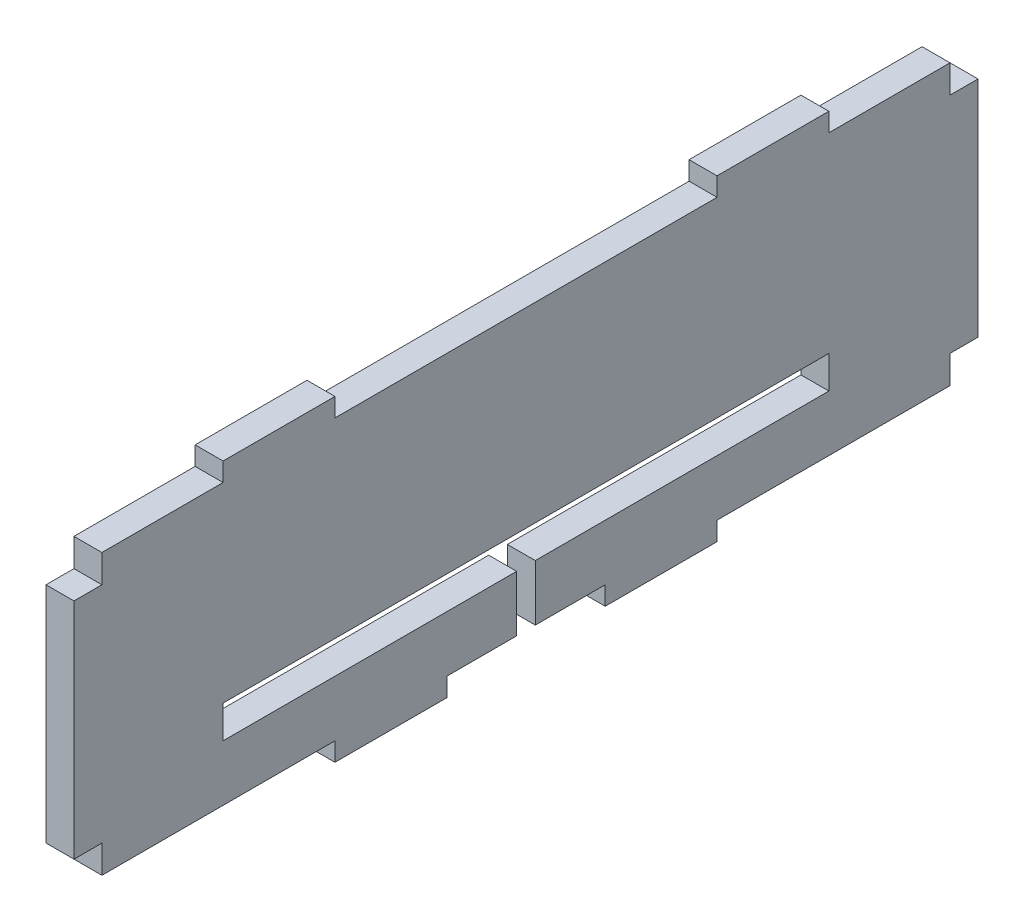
ISO-10303-21;
HEADER;
FILE_DESCRIPTION(('STEP AP214'),'2;1');
FILE_NAME('part.step','',(''),(''),'','','');
FILE_SCHEMA(('AUTOMOTIVE_DESIGN { 1 0 10303 214 1 1 1 1 }'));
ENDSEC;
DATA;
#1=APPLICATION_CONTEXT('core data for automotive mechanical design processes');
#2=APPLICATION_PROTOCOL_DEFINITION('international standard','automotive_design',2000,#1);
#3=PRODUCT_CONTEXT('',#1,'mechanical');
#4=PRODUCT('Part','Part','',(#3));
#5=PRODUCT_RELATED_PRODUCT_CATEGORY('part','',(#4));
#6=PRODUCT_DEFINITION_FORMATION('','',#4);
#7=PRODUCT_DEFINITION_CONTEXT('part definition',#1,'design');
#8=PRODUCT_DEFINITION('design','',#6,#7);
#9=PRODUCT_DEFINITION_SHAPE('','',#8);
#10=(LENGTH_UNIT() NAMED_UNIT(*) SI_UNIT(.MILLI.,.METRE.));
#11=(NAMED_UNIT(*) PLANE_ANGLE_UNIT() SI_UNIT($,.RADIAN.));
#12=(NAMED_UNIT(*) SI_UNIT($,.STERADIAN.) SOLID_ANGLE_UNIT());
#13=UNCERTAINTY_MEASURE_WITH_UNIT(LENGTH_MEASURE(1.E-05),#10,'distance_accuracy_value','');
#14=(GEOMETRIC_REPRESENTATION_CONTEXT(3) GLOBAL_UNCERTAINTY_ASSIGNED_CONTEXT((#13)) GLOBAL_UNIT_ASSIGNED_CONTEXT((#10,
#11,#12)) REPRESENTATION_CONTEXT('',''));
#15=CARTESIAN_POINT('',(0.,0.,0.));
#16=DIRECTION('',(0.,0.,1.));
#17=DIRECTION('',(1.,0.,0.));
#18=AXIS2_PLACEMENT_3D('',#15,#16,#17);
#19=CARTESIAN_POINT('',(3.,29.,0.));
#20=DIRECTION('',(0.,1.,0.));
#21=DIRECTION('',(0.,0.,1.));
#22=AXIS2_PLACEMENT_3D('',#19,#20,#21);
#23=PLANE('',#22);
#24=DIRECTION('',(0.,0.,-1.));
#25=VECTOR('',#24,1.);
#26=CARTESIAN_POINT('',(0.,29.,0.));
#27=LINE('',#26,#25);
#28=CARTESIAN_POINT('',(0.,29.,-94.));
#29=VERTEX_POINT('',#28);
#30=CARTESIAN_POINT('',(0.,29.,-97.));
#31=VERTEX_POINT('',#30);
#32=EDGE_CURVE('E295',#29,#31,#27,.T.);
#33=ORIENTED_EDGE('',*,*,#32,.F.);
#34=DIRECTION('',(-1.,0.,0.));
#35=VECTOR('',#34,1.);
#36=CARTESIAN_POINT('',(3.,29.,-94.));
#37=LINE('',#36,#35);
#38=CARTESIAN_POINT('',(3.,29.,-94.));
#39=VERTEX_POINT('',#38);
#40=EDGE_CURVE('E11',#39,#29,#37,.T.);
#41=ORIENTED_EDGE('',*,*,#40,.F.);
#42=DIRECTION('',(0.,0.,-1.));
#43=VECTOR('',#42,1.);
#44=CARTESIAN_POINT('',(3.,29.,0.));
#45=LINE('',#44,#43);
#46=CARTESIAN_POINT('',(3.,29.,-97.));
#47=VERTEX_POINT('',#46);
#48=EDGE_CURVE('E379',#39,#47,#45,.T.);
#49=ORIENTED_EDGE('',*,*,#48,.T.);
#50=DIRECTION('',(-1.,0.,0.));
#51=VECTOR('',#50,1.);
#52=CARTESIAN_POINT('',(3.,29.,-97.));
#53=LINE('',#52,#51);
#54=EDGE_CURVE('E170',#47,#31,#53,.T.);
#55=ORIENTED_EDGE('',*,*,#54,.T.);
#56=EDGE_LOOP('',(#33,#41,#49,#55));
#57=FACE_BOUND('',#56,.T.);
#58=ADVANCED_FACE('F35',(#57),#23,.T.);
#59=CARTESIAN_POINT('',(3.,0.,-94.));
#60=DIRECTION('',(0.,0.,-1.));
#61=DIRECTION('',(-1.,0.,0.));
#62=AXIS2_PLACEMENT_3D('',#59,#60,#61);
#63=PLANE('',#62);
#64=DIRECTION('',(0.,-1.,0.));
#65=VECTOR('',#64,1.);
#66=CARTESIAN_POINT('',(0.,0.,-94.));
#67=LINE('',#66,#65);
#68=CARTESIAN_POINT('',(0.,32.,-94.));
#69=VERTEX_POINT('',#68);
#70=EDGE_CURVE('E298',#69,#29,#67,.T.);
#71=ORIENTED_EDGE('',*,*,#70,.F.);
#72=DIRECTION('',(-1.,0.,0.));
#73=VECTOR('',#72,1.);
#74=CARTESIAN_POINT('',(3.,32.,-94.));
#75=LINE('',#74,#73);
#76=CARTESIAN_POINT('',(3.,32.,-94.));
#77=VERTEX_POINT('',#76);
#78=EDGE_CURVE('E43',#77,#69,#75,.T.);
#79=ORIENTED_EDGE('',*,*,#78,.F.);
#80=DIRECTION('',(0.,-1.,0.));
#81=VECTOR('',#80,1.);
#82=CARTESIAN_POINT('',(3.,0.,-94.));
#83=LINE('',#82,#81);
#84=EDGE_CURVE('E479',#77,#39,#83,.T.);
#85=ORIENTED_EDGE('',*,*,#84,.T.);
#86=ORIENTED_EDGE('',*,*,#40,.T.);
#87=EDGE_LOOP('',(#71,#79,#85,#86));
#88=FACE_BOUND('',#87,.T.);
#89=ADVANCED_FACE('F467',(#88),#63,.T.);
#90=CARTESIAN_POINT('',(3.,32.,0.));
#91=DIRECTION('',(0.,1.,0.));
#92=DIRECTION('',(0.,0.,1.));
#93=AXIS2_PLACEMENT_3D('',#90,#91,#92);
#94=PLANE('',#93);
#95=DIRECTION('',(0.,0.,-1.));
#96=VECTOR('',#95,1.);
#97=CARTESIAN_POINT('',(0.,32.,0.));
#98=LINE('',#97,#96);
#99=CARTESIAN_POINT('',(0.,32.,-81.));
#100=VERTEX_POINT('',#99);
#101=EDGE_CURVE('E301',#100,#69,#98,.T.);
#102=ORIENTED_EDGE('',*,*,#101,.F.);
#103=DIRECTION('',(-1.,0.,0.));
#104=VECTOR('',#103,1.);
#105=CARTESIAN_POINT('',(3.,32.,-81.));
#106=LINE('',#105,#104);
#107=CARTESIAN_POINT('',(3.,32.,-81.));
#108=VERTEX_POINT('',#107);
#109=EDGE_CURVE('E456',#108,#100,#106,.T.);
#110=ORIENTED_EDGE('',*,*,#109,.F.);
#111=DIRECTION('',(0.,0.,-1.));
#112=VECTOR('',#111,1.);
#113=CARTESIAN_POINT('',(3.,32.,0.));
#114=LINE('',#113,#112);
#115=EDGE_CURVE('E463',#108,#77,#114,.T.);
#116=ORIENTED_EDGE('',*,*,#115,.T.);
#117=ORIENTED_EDGE('',*,*,#78,.T.);
#118=EDGE_LOOP('',(#102,#110,#116,#117));
#119=FACE_BOUND('',#118,.T.);
#120=ADVANCED_FACE('F461',(#119),#94,.T.);
#121=CARTESIAN_POINT('',(3.,0.,-81.));
#122=DIRECTION('',(0.,0.,-1.));
#123=DIRECTION('',(-1.,0.,0.));
#124=AXIS2_PLACEMENT_3D('',#121,#122,#123);
#125=PLANE('',#124);
#126=DIRECTION('',(0.,-1.,0.));
#127=VECTOR('',#126,1.);
#128=CARTESIAN_POINT('',(0.,0.,-81.));
#129=LINE('',#128,#127);
#130=CARTESIAN_POINT('',(0.,34.,-81.));
#131=VERTEX_POINT('',#130);
#132=EDGE_CURVE('E304',#131,#100,#129,.T.);
#133=ORIENTED_EDGE('',*,*,#132,.F.);
#134=DIRECTION('',(-1.,0.,0.));
#135=VECTOR('',#134,1.);
#136=CARTESIAN_POINT('',(3.,34.,-81.));
#137=LINE('',#136,#135);
#138=CARTESIAN_POINT('',(3.,34.,-81.));
#139=VERTEX_POINT('',#138);
#140=EDGE_CURVE('E454',#139,#131,#137,.T.);
#141=ORIENTED_EDGE('',*,*,#140,.F.);
#142=DIRECTION('',(0.,-1.,0.));
#143=VECTOR('',#142,1.);
#144=CARTESIAN_POINT('',(3.,0.,-81.));
#145=LINE('',#144,#143);
#146=EDGE_CURVE('E476',#139,#108,#145,.T.);
#147=ORIENTED_EDGE('',*,*,#146,.T.);
#148=ORIENTED_EDGE('',*,*,#109,.T.);
#149=EDGE_LOOP('',(#133,#141,#147,#148));
#150=FACE_BOUND('',#149,.T.);
#151=ADVANCED_FACE('F473',(#150),#125,.T.);
#152=CARTESIAN_POINT('',(3.,34.,0.));
#153=DIRECTION('',(0.,1.,0.));
#154=DIRECTION('',(0.,0.,1.));
#155=AXIS2_PLACEMENT_3D('',#152,#153,#154);
#156=PLANE('',#155);
#157=DIRECTION('',(0.,0.,-1.));
#158=VECTOR('',#157,1.);
#159=CARTESIAN_POINT('',(0.,34.,0.));
#160=LINE('',#159,#158);
#161=CARTESIAN_POINT('',(0.,34.,-69.));
#162=VERTEX_POINT('',#161);
#163=EDGE_CURVE('E307',#162,#131,#160,.T.);
#164=ORIENTED_EDGE('',*,*,#163,.F.);
#165=DIRECTION('',(-1.,0.,0.));
#166=VECTOR('',#165,1.);
#167=CARTESIAN_POINT('',(3.,34.,-69.));
#168=LINE('',#167,#166);
#169=CARTESIAN_POINT('',(3.,34.,-69.));
#170=VERTEX_POINT('',#169);
#171=EDGE_CURVE('E452',#170,#162,#168,.T.);
#172=ORIENTED_EDGE('',*,*,#171,.F.);
#173=DIRECTION('',(0.,0.,-1.));
#174=VECTOR('',#173,1.);
#175=CARTESIAN_POINT('',(3.,34.,0.));
#176=LINE('',#175,#174);
#177=EDGE_CURVE('E481',#170,#139,#176,.T.);
#178=ORIENTED_EDGE('',*,*,#177,.T.);
#179=ORIENTED_EDGE('',*,*,#140,.T.);
#180=EDGE_LOOP('',(#164,#172,#178,#179));
#181=FACE_BOUND('',#180,.T.);
#182=ADVANCED_FACE('F577',(#181),#156,.T.);
#183=CARTESIAN_POINT('',(3.,0.,-69.));
#184=DIRECTION('',(0.,0.,1.));
#185=DIRECTION('',(1.,0.,0.));
#186=AXIS2_PLACEMENT_3D('',#183,#184,#185);
#187=PLANE('',#186);
#188=DIRECTION('',(0.,1.,0.));
#189=VECTOR('',#188,1.);
#190=CARTESIAN_POINT('',(0.,0.,-69.));
#191=LINE('',#190,#189);
#192=CARTESIAN_POINT('',(0.,32.,-69.));
#193=VERTEX_POINT('',#192);
#194=EDGE_CURVE('E310',#193,#162,#191,.T.);
#195=ORIENTED_EDGE('',*,*,#194,.F.);
#196=DIRECTION('',(-1.,0.,0.));
#197=VECTOR('',#196,1.);
#198=CARTESIAN_POINT('',(3.,32.,-69.));
#199=LINE('',#198,#197);
#200=CARTESIAN_POINT('',(3.,32.,-69.));
#201=VERTEX_POINT('',#200);
#202=EDGE_CURVE('E450',#201,#193,#199,.T.);
#203=ORIENTED_EDGE('',*,*,#202,.F.);
#204=DIRECTION('',(0.,1.,0.));
#205=VECTOR('',#204,1.);
#206=CARTESIAN_POINT('',(3.,0.,-69.));
#207=LINE('',#206,#205);
#208=EDGE_CURVE('E487',#201,#170,#207,.T.);
#209=ORIENTED_EDGE('',*,*,#208,.T.);
#210=ORIENTED_EDGE('',*,*,#171,.T.);
#211=EDGE_LOOP('',(#195,#203,#209,#210));
#212=FACE_BOUND('',#211,.T.);
#213=ADVANCED_FACE('F578',(#212),#187,.T.);
#214=CARTESIAN_POINT('',(3.,32.,0.));
#215=DIRECTION('',(0.,1.,0.));
#216=DIRECTION('',(0.,0.,1.));
#217=AXIS2_PLACEMENT_3D('',#214,#215,#216);
#218=PLANE('',#217);
#219=DIRECTION('',(0.,0.,-1.));
#220=VECTOR('',#219,1.);
#221=CARTESIAN_POINT('',(0.,32.,0.));
#222=LINE('',#221,#220);
#223=CARTESIAN_POINT('',(0.,32.,-28.));
#224=VERTEX_POINT('',#223);
#225=EDGE_CURVE('E314',#224,#193,#222,.T.);
#226=ORIENTED_EDGE('',*,*,#225,.F.);
#227=DIRECTION('',(-1.,0.,0.));
#228=VECTOR('',#227,1.);
#229=CARTESIAN_POINT('',(3.,32.,-28.));
#230=LINE('',#229,#228);
#231=CARTESIAN_POINT('',(3.,32.,-28.));
#232=VERTEX_POINT('',#231);
#233=EDGE_CURVE('E448',#232,#224,#230,.T.);
#234=ORIENTED_EDGE('',*,*,#233,.F.);
#235=DIRECTION('',(0.,0.,-1.));
#236=VECTOR('',#235,1.);
#237=CARTESIAN_POINT('',(3.,32.,0.));
#238=LINE('',#237,#236);
#239=EDGE_CURVE('E491',#232,#201,#238,.T.);
#240=ORIENTED_EDGE('',*,*,#239,.T.);
#241=ORIENTED_EDGE('',*,*,#202,.T.);
#242=EDGE_LOOP('',(#226,#234,#240,#241));
#243=FACE_BOUND('',#242,.T.);
#244=ADVANCED_FACE('F581',(#243),#218,.T.);
#245=CARTESIAN_POINT('',(3.,0.,-28.));
#246=DIRECTION('',(0.,0.,-1.));
#247=DIRECTION('',(-1.,0.,0.));
#248=AXIS2_PLACEMENT_3D('',#245,#246,#247);
#249=PLANE('',#248);
#250=DIRECTION('',(0.,-1.,0.));
#251=VECTOR('',#250,1.);
#252=CARTESIAN_POINT('',(0.,0.,-28.));
#253=LINE('',#252,#251);
#254=CARTESIAN_POINT('',(0.,34.,-28.));
#255=VERTEX_POINT('',#254);
#256=EDGE_CURVE('E317',#255,#224,#253,.T.);
#257=ORIENTED_EDGE('',*,*,#256,.F.);
#258=DIRECTION('',(-1.,0.,0.));
#259=VECTOR('',#258,1.);
#260=CARTESIAN_POINT('',(3.,34.,-28.));
#261=LINE('',#260,#259);
#262=CARTESIAN_POINT('',(3.,34.,-28.));
#263=VERTEX_POINT('',#262);
#264=EDGE_CURVE('E446',#263,#255,#261,.T.);
#265=ORIENTED_EDGE('',*,*,#264,.F.);
#266=DIRECTION('',(0.,-1.,0.));
#267=VECTOR('',#266,1.);
#268=CARTESIAN_POINT('',(3.,0.,-28.));
#269=LINE('',#268,#267);
#270=EDGE_CURVE('E494',#263,#232,#269,.T.);
#271=ORIENTED_EDGE('',*,*,#270,.T.);
#272=ORIENTED_EDGE('',*,*,#233,.T.);
#273=EDGE_LOOP('',(#257,#265,#271,#272));
#274=FACE_BOUND('',#273,.T.);
#275=ADVANCED_FACE('F585',(#274),#249,.T.);
#276=CARTESIAN_POINT('',(0.,34.,-16.));
#277=VERTEX_POINT('',#276);
#278=EDGE_CURVE('E311',#277,#255,#160,.T.);
#279=ORIENTED_EDGE('',*,*,#278,.F.);
#280=DIRECTION('',(-1.,0.,0.));
#281=VECTOR('',#280,1.);
#282=CARTESIAN_POINT('',(3.,34.,-16.));
#283=LINE('',#282,#281);
#284=CARTESIAN_POINT('',(3.,34.,-16.));
#285=VERTEX_POINT('',#284);
#286=EDGE_CURVE('E444',#285,#277,#283,.T.);
#287=ORIENTED_EDGE('',*,*,#286,.F.);
#288=EDGE_CURVE('E488',#285,#263,#176,.T.);
#289=ORIENTED_EDGE('',*,*,#288,.T.);
#290=ORIENTED_EDGE('',*,*,#264,.T.);
#291=EDGE_LOOP('',(#279,#287,#289,#290));
#292=FACE_BOUND('',#291,.T.);
#293=ADVANCED_FACE('F589',(#292),#156,.T.);
#294=CARTESIAN_POINT('',(3.,0.,-16.));
#295=DIRECTION('',(0.,0.,1.));
#296=DIRECTION('',(1.,0.,0.));
#297=AXIS2_PLACEMENT_3D('',#294,#295,#296);
#298=PLANE('',#297);
#299=DIRECTION('',(0.,1.,0.));
#300=VECTOR('',#299,1.);
#301=CARTESIAN_POINT('',(0.,0.,-16.));
#302=LINE('',#301,#300);
#303=CARTESIAN_POINT('',(0.,32.,-16.));
#304=VERTEX_POINT('',#303);
#305=EDGE_CURVE('E320',#304,#277,#302,.T.);
#306=ORIENTED_EDGE('',*,*,#305,.F.);
#307=DIRECTION('',(-1.,0.,0.));
#308=VECTOR('',#307,1.);
#309=CARTESIAN_POINT('',(3.,32.,-16.));
#310=LINE('',#309,#308);
#311=CARTESIAN_POINT('',(3.,32.,-16.));
#312=VERTEX_POINT('',#311);
#313=EDGE_CURVE('E442',#312,#304,#310,.T.);
#314=ORIENTED_EDGE('',*,*,#313,.F.);
#315=DIRECTION('',(0.,1.,0.));
#316=VECTOR('',#315,1.);
#317=CARTESIAN_POINT('',(3.,0.,-16.));
#318=LINE('',#317,#316);
#319=EDGE_CURVE('E497',#312,#285,#318,.T.);
#320=ORIENTED_EDGE('',*,*,#319,.T.);
#321=ORIENTED_EDGE('',*,*,#286,.T.);
#322=EDGE_LOOP('',(#306,#314,#320,#321));
#323=FACE_BOUND('',#322,.T.);
#324=ADVANCED_FACE('F593',(#323),#298,.T.);
#325=CARTESIAN_POINT('',(3.,32.,0.));
#326=DIRECTION('',(0.,1.,0.));
#327=DIRECTION('',(0.,0.,1.));
#328=AXIS2_PLACEMENT_3D('',#325,#326,#327);
#329=PLANE('',#328);
#330=DIRECTION('',(0.,0.,-1.));
#331=VECTOR('',#330,1.);
#332=CARTESIAN_POINT('',(0.,32.,0.));
#333=LINE('',#332,#331);
#334=CARTESIAN_POINT('',(0.,32.,-2.99999999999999));
#335=VERTEX_POINT('',#334);
#336=EDGE_CURVE('E323',#335,#304,#333,.T.);
#337=ORIENTED_EDGE('',*,*,#336,.F.);
#338=DIRECTION('',(-1.,0.,0.));
#339=VECTOR('',#338,1.);
#340=CARTESIAN_POINT('',(3.,32.,-2.99999999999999));
#341=LINE('',#340,#339);
#342=CARTESIAN_POINT('',(3.,32.,-2.99999999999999));
#343=VERTEX_POINT('',#342);
#344=EDGE_CURVE('E440',#343,#335,#341,.T.);
#345=ORIENTED_EDGE('',*,*,#344,.F.);
#346=DIRECTION('',(0.,0.,-1.));
#347=VECTOR('',#346,1.);
#348=CARTESIAN_POINT('',(3.,32.,0.));
#349=LINE('',#348,#347);
#350=EDGE_CURVE('E500',#343,#312,#349,.T.);
#351=ORIENTED_EDGE('',*,*,#350,.T.);
#352=ORIENTED_EDGE('',*,*,#313,.T.);
#353=EDGE_LOOP('',(#337,#345,#351,#352));
#354=FACE_BOUND('',#353,.T.);
#355=ADVANCED_FACE('F597',(#354),#329,.T.);
#356=CARTESIAN_POINT('',(3.,0.,-2.99999999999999));
#357=DIRECTION('',(0.,0.,1.));
#358=DIRECTION('',(1.,0.,0.));
#359=AXIS2_PLACEMENT_3D('',#356,#357,#358);
#360=PLANE('',#359);
#361=DIRECTION('',(0.,1.,0.));
#362=VECTOR('',#361,1.);
#363=CARTESIAN_POINT('',(0.,0.,-2.99999999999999));
#364=LINE('',#363,#362);
#365=CARTESIAN_POINT('',(0.,29.,-2.99999999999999));
#366=VERTEX_POINT('',#365);
#367=EDGE_CURVE('E326',#366,#335,#364,.T.);
#368=ORIENTED_EDGE('',*,*,#367,.F.);
#369=DIRECTION('',(-1.,0.,0.));
#370=VECTOR('',#369,1.);
#371=CARTESIAN_POINT('',(3.,29.,-2.99999999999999));
#372=LINE('',#371,#370);
#373=CARTESIAN_POINT('',(3.,29.,-2.99999999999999));
#374=VERTEX_POINT('',#373);
#375=EDGE_CURVE('E438',#374,#366,#372,.T.);
#376=ORIENTED_EDGE('',*,*,#375,.F.);
#377=DIRECTION('',(0.,1.,0.));
#378=VECTOR('',#377,1.);
#379=CARTESIAN_POINT('',(3.,0.,-2.99999999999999));
#380=LINE('',#379,#378);
#381=EDGE_CURVE('E503',#374,#343,#380,.T.);
#382=ORIENTED_EDGE('',*,*,#381,.T.);
#383=ORIENTED_EDGE('',*,*,#344,.T.);
#384=EDGE_LOOP('',(#368,#376,#382,#383));
#385=FACE_BOUND('',#384,.T.);
#386=ADVANCED_FACE('F601',(#385),#360,.T.);
#387=CARTESIAN_POINT('',(3.,29.,0.));
#388=DIRECTION('',(0.,1.,0.));
#389=DIRECTION('',(0.,0.,1.));
#390=AXIS2_PLACEMENT_3D('',#387,#388,#389);
#391=PLANE('',#390);
#392=DIRECTION('',(0.,0.,-1.));
#393=VECTOR('',#392,1.);
#394=CARTESIAN_POINT('',(0.,29.,0.));
#395=LINE('',#394,#393);
#396=CARTESIAN_POINT('',(0.,29.,0.));
#397=VERTEX_POINT('',#396);
#398=EDGE_CURVE('E329',#397,#366,#395,.T.);
#399=ORIENTED_EDGE('',*,*,#398,.F.);
#400=DIRECTION('',(-1.,0.,0.));
#401=VECTOR('',#400,1.);
#402=CARTESIAN_POINT('',(3.,29.,0.));
#403=LINE('',#402,#401);
#404=CARTESIAN_POINT('',(3.,29.,0.));
#405=VERTEX_POINT('',#404);
#406=EDGE_CURVE('E436',#405,#397,#403,.T.);
#407=ORIENTED_EDGE('',*,*,#406,.F.);
#408=DIRECTION('',(0.,0.,-1.));
#409=VECTOR('',#408,1.);
#410=CARTESIAN_POINT('',(3.,29.,0.));
#411=LINE('',#410,#409);
#412=EDGE_CURVE('E506',#405,#374,#411,.T.);
#413=ORIENTED_EDGE('',*,*,#412,.T.);
#414=ORIENTED_EDGE('',*,*,#375,.T.);
#415=EDGE_LOOP('',(#399,#407,#413,#414));
#416=FACE_BOUND('',#415,.T.);
#417=ADVANCED_FACE('F605',(#416),#391,.T.);
#418=CARTESIAN_POINT('',(3.,0.,0.));
#419=DIRECTION('',(0.,0.,-1.));
#420=DIRECTION('',(-1.,0.,0.));
#421=AXIS2_PLACEMENT_3D('',#418,#419,#420);
#422=PLANE('',#421);
#423=DIRECTION('',(0.,-1.,0.));
#424=VECTOR('',#423,1.);
#425=CARTESIAN_POINT('',(0.,0.,0.));
#426=LINE('',#425,#424);
#427=CARTESIAN_POINT('',(0.,5.,0.));
#428=VERTEX_POINT('',#427);
#429=EDGE_CURVE('E332',#397,#428,#426,.T.);
#430=ORIENTED_EDGE('',*,*,#429,.T.);
#431=DIRECTION('',(-1.,0.,0.));
#432=VECTOR('',#431,1.);
#433=CARTESIAN_POINT('',(3.,5.,0.));
#434=LINE('',#433,#432);
#435=CARTESIAN_POINT('',(3.,5.,0.));
#436=VERTEX_POINT('',#435);
#437=EDGE_CURVE('E433',#436,#428,#434,.T.);
#438=ORIENTED_EDGE('',*,*,#437,.F.);
#439=DIRECTION('',(0.,-1.,0.));
#440=VECTOR('',#439,1.);
#441=CARTESIAN_POINT('',(3.,0.,0.));
#442=LINE('',#441,#440);
#443=EDGE_CURVE('E509',#405,#436,#442,.T.);
#444=ORIENTED_EDGE('',*,*,#443,.F.);
#445=ORIENTED_EDGE('',*,*,#406,.T.);
#446=EDGE_LOOP('',(#430,#438,#444,#445));
#447=FACE_BOUND('',#446,.T.);
#448=ADVANCED_FACE('F609',(#447),#422,.F.);
#449=CARTESIAN_POINT('',(3.,5.,0.));
#450=DIRECTION('',(0.,1.,0.));
#451=DIRECTION('',(0.,0.,1.));
#452=AXIS2_PLACEMENT_3D('',#449,#450,#451);
#453=PLANE('',#452);
#454=DIRECTION('',(0.,0.,-1.));
#455=VECTOR('',#454,1.);
#456=CARTESIAN_POINT('',(0.,5.,0.));
#457=LINE('',#456,#455);
#458=CARTESIAN_POINT('',(0.,5.,-3.));
#459=VERTEX_POINT('',#458);
#460=EDGE_CURVE('E334',#428,#459,#457,.T.);
#461=ORIENTED_EDGE('',*,*,#460,.T.);
#462=DIRECTION('',(-1.,0.,0.));
#463=VECTOR('',#462,1.);
#464=CARTESIAN_POINT('',(3.,5.,-3.));
#465=LINE('',#464,#463);
#466=CARTESIAN_POINT('',(3.,5.,-3.));
#467=VERTEX_POINT('',#466);
#468=EDGE_CURVE('E430',#467,#459,#465,.T.);
#469=ORIENTED_EDGE('',*,*,#468,.F.);
#470=DIRECTION('',(0.,0.,-1.));
#471=VECTOR('',#470,1.);
#472=CARTESIAN_POINT('',(3.,5.,0.));
#473=LINE('',#472,#471);
#474=EDGE_CURVE('E511',#436,#467,#473,.T.);
#475=ORIENTED_EDGE('',*,*,#474,.F.);
#476=ORIENTED_EDGE('',*,*,#437,.T.);
#477=EDGE_LOOP('',(#461,#469,#475,#476));
#478=FACE_BOUND('',#477,.T.);
#479=ADVANCED_FACE('F613',(#478),#453,.F.);
#480=CARTESIAN_POINT('',(3.,0.,-3.));
#481=DIRECTION('',(0.,0.,-1.));
#482=DIRECTION('',(0.,1.,0.));
#483=AXIS2_PLACEMENT_3D('',#480,#481,#482);
#484=PLANE('',#483);
#485=DIRECTION('',(0.,-1.,0.));
#486=VECTOR('',#485,1.);
#487=CARTESIAN_POINT('',(0.,0.,-3.));
#488=LINE('',#487,#486);
#489=CARTESIAN_POINT('',(0.,2.,-3.));
#490=VERTEX_POINT('',#489);
#491=EDGE_CURVE('E336',#459,#490,#488,.T.);
#492=ORIENTED_EDGE('',*,*,#491,.T.);
#493=DIRECTION('',(-1.,0.,0.));
#494=VECTOR('',#493,1.);
#495=CARTESIAN_POINT('',(3.,2.,-3.));
#496=LINE('',#495,#494);
#497=CARTESIAN_POINT('',(3.,2.,-3.));
#498=VERTEX_POINT('',#497);
#499=EDGE_CURVE('E427',#498,#490,#496,.T.);
#500=ORIENTED_EDGE('',*,*,#499,.F.);
#501=DIRECTION('',(0.,-1.,0.));
#502=VECTOR('',#501,1.);
#503=CARTESIAN_POINT('',(3.,0.,-3.));
#504=LINE('',#503,#502);
#505=EDGE_CURVE('E513',#467,#498,#504,.T.);
#506=ORIENTED_EDGE('',*,*,#505,.F.);
#507=ORIENTED_EDGE('',*,*,#468,.T.);
#508=EDGE_LOOP('',(#492,#500,#506,#507));
#509=FACE_BOUND('',#508,.T.);
#510=ADVANCED_FACE('F617',(#509),#484,.F.);
#511=CARTESIAN_POINT('',(3.,2.,0.));
#512=DIRECTION('',(0.,1.,0.));
#513=DIRECTION('',(0.,0.,1.));
#514=AXIS2_PLACEMENT_3D('',#511,#512,#513);
#515=PLANE('',#514);
#516=DIRECTION('',(0.,0.,-1.));
#517=VECTOR('',#516,1.);
#518=CARTESIAN_POINT('',(0.,2.,0.));
#519=LINE('',#518,#517);
#520=CARTESIAN_POINT('',(0.,2.,-28.));
#521=VERTEX_POINT('',#520);
#522=EDGE_CURVE('E338',#490,#521,#519,.T.);
#523=ORIENTED_EDGE('',*,*,#522,.T.);
#524=DIRECTION('',(-1.,0.,0.));
#525=VECTOR('',#524,1.);
#526=CARTESIAN_POINT('',(3.,2.,-28.));
#527=LINE('',#526,#525);
#528=CARTESIAN_POINT('',(3.,2.,-28.));
#529=VERTEX_POINT('',#528);
#530=EDGE_CURVE('E424',#529,#521,#527,.T.);
#531=ORIENTED_EDGE('',*,*,#530,.F.);
#532=DIRECTION('',(0.,0.,-1.));
#533=VECTOR('',#532,1.);
#534=CARTESIAN_POINT('',(3.,2.,0.));
#535=LINE('',#534,#533);
#536=EDGE_CURVE('E515',#498,#529,#535,.T.);
#537=ORIENTED_EDGE('',*,*,#536,.F.);
#538=ORIENTED_EDGE('',*,*,#499,.T.);
#539=EDGE_LOOP('',(#523,#531,#537,#538));
#540=FACE_BOUND('',#539,.T.);
#541=ADVANCED_FACE('F621',(#540),#515,.F.);
#542=CARTESIAN_POINT('',(3.,0.,-28.));
#543=DIRECTION('',(0.,0.,-1.));
#544=DIRECTION('',(-1.,0.,0.));
#545=AXIS2_PLACEMENT_3D('',#542,#543,#544);
#546=PLANE('',#545);
#547=DIRECTION('',(0.,-1.,0.));
#548=VECTOR('',#547,1.);
#549=CARTESIAN_POINT('',(0.,0.,-28.));
#550=LINE('',#549,#548);
#551=CARTESIAN_POINT('',(0.,0.,-28.));
#552=VERTEX_POINT('',#551);
#553=EDGE_CURVE('E340',#521,#552,#550,.T.);
#554=ORIENTED_EDGE('',*,*,#553,.T.);
#555=DIRECTION('',(-1.,0.,0.));
#556=VECTOR('',#555,1.);
#557=CARTESIAN_POINT('',(3.,0.,-28.));
#558=LINE('',#557,#556);
#559=CARTESIAN_POINT('',(3.,0.,-28.));
#560=VERTEX_POINT('',#559);
#561=EDGE_CURVE('E421',#560,#552,#558,.T.);
#562=ORIENTED_EDGE('',*,*,#561,.F.);
#563=DIRECTION('',(0.,-1.,0.));
#564=VECTOR('',#563,1.);
#565=CARTESIAN_POINT('',(3.,0.,-28.));
#566=LINE('',#565,#564);
#567=EDGE_CURVE('E517',#529,#560,#566,.T.);
#568=ORIENTED_EDGE('',*,*,#567,.F.);
#569=ORIENTED_EDGE('',*,*,#530,.T.);
#570=EDGE_LOOP('',(#554,#562,#568,#569));
#571=FACE_BOUND('',#570,.T.);
#572=ADVANCED_FACE('F625',(#571),#546,.F.);
#573=CARTESIAN_POINT('',(3.,0.,0.));
#574=DIRECTION('',(0.,1.,0.));
#575=DIRECTION('',(0.,0.,1.));
#576=AXIS2_PLACEMENT_3D('',#573,#574,#575);
#577=PLANE('',#576);
#578=DIRECTION('',(0.,0.,-1.));
#579=VECTOR('',#578,1.);
#580=CARTESIAN_POINT('',(0.,0.,0.));
#581=LINE('',#580,#579);
#582=CARTESIAN_POINT('',(0.,0.,-40.));
#583=VERTEX_POINT('',#582);
#584=EDGE_CURVE('E342',#552,#583,#581,.T.);
#585=ORIENTED_EDGE('',*,*,#584,.T.);
#586=DIRECTION('',(-1.,0.,0.));
#587=VECTOR('',#586,1.);
#588=CARTESIAN_POINT('',(3.,0.,-40.));
#589=LINE('',#588,#587);
#590=CARTESIAN_POINT('',(3.,0.,-40.));
#591=VERTEX_POINT('',#590);
#592=EDGE_CURVE('E418',#591,#583,#589,.T.);
#593=ORIENTED_EDGE('',*,*,#592,.F.);
#594=DIRECTION('',(0.,0.,-1.));
#595=VECTOR('',#594,1.);
#596=CARTESIAN_POINT('',(3.,0.,0.));
#597=LINE('',#596,#595);
#598=EDGE_CURVE('E519',#560,#591,#597,.T.);
#599=ORIENTED_EDGE('',*,*,#598,.F.);
#600=ORIENTED_EDGE('',*,*,#561,.T.);
#601=EDGE_LOOP('',(#585,#593,#599,#600));
#602=FACE_BOUND('',#601,.T.);
#603=ADVANCED_FACE('F629',(#602),#577,.F.);
#604=CARTESIAN_POINT('',(3.,0.,-40.));
#605=DIRECTION('',(0.,0.,1.));
#606=DIRECTION('',(1.,0.,0.));
#607=AXIS2_PLACEMENT_3D('',#604,#605,#606);
#608=PLANE('',#607);
#609=DIRECTION('',(0.,1.,0.));
#610=VECTOR('',#609,1.);
#611=CARTESIAN_POINT('',(0.,0.,-40.));
#612=LINE('',#611,#610);
#613=CARTESIAN_POINT('',(0.,2.,-40.));
#614=VERTEX_POINT('',#613);
#615=EDGE_CURVE('E344',#583,#614,#612,.T.);
#616=ORIENTED_EDGE('',*,*,#615,.T.);
#617=DIRECTION('',(-1.,0.,0.));
#618=VECTOR('',#617,1.);
#619=CARTESIAN_POINT('',(3.,2.,-40.));
#620=LINE('',#619,#618);
#621=CARTESIAN_POINT('',(3.,2.,-40.));
#622=VERTEX_POINT('',#621);
#623=EDGE_CURVE('E416',#622,#614,#620,.T.);
#624=ORIENTED_EDGE('',*,*,#623,.F.);
#625=DIRECTION('',(0.,1.,0.));
#626=VECTOR('',#625,1.);
#627=CARTESIAN_POINT('',(3.,0.,-40.));
#628=LINE('',#627,#626);
#629=EDGE_CURVE('E521',#591,#622,#628,.T.);
#630=ORIENTED_EDGE('',*,*,#629,.F.);
#631=ORIENTED_EDGE('',*,*,#592,.T.);
#632=EDGE_LOOP('',(#616,#624,#630,#631));
#633=FACE_BOUND('',#632,.T.);
#634=ADVANCED_FACE('F631',(#633),#608,.F.);
#635=CARTESIAN_POINT('',(3.,2.,0.));
#636=DIRECTION('',(0.,-1.,0.));
#637=DIRECTION('',(0.,0.,-1.));
#638=AXIS2_PLACEMENT_3D('',#635,#636,#637);
#639=PLANE('',#638);
#640=DIRECTION('',(0.,0.,1.));
#641=VECTOR('',#640,1.);
#642=CARTESIAN_POINT('',(0.,2.,0.));
#643=LINE('',#642,#641);
#644=CARTESIAN_POINT('',(0.,2.,-47.5));
#645=VERTEX_POINT('',#644);
#646=EDGE_CURVE('E348',#645,#614,#643,.T.);
#647=ORIENTED_EDGE('',*,*,#646,.F.);
#648=DIRECTION('',(-1.,0.,0.));
#649=VECTOR('',#648,1.);
#650=CARTESIAN_POINT('',(3.,2.,-47.5));
#651=LINE('',#650,#649);
#652=CARTESIAN_POINT('',(3.,2.,-47.5));
#653=VERTEX_POINT('',#652);
#654=EDGE_CURVE('E414',#653,#645,#651,.T.);
#655=ORIENTED_EDGE('',*,*,#654,.F.);
#656=DIRECTION('',(0.,0.,1.));
#657=VECTOR('',#656,1.);
#658=CARTESIAN_POINT('',(3.,2.,0.));
#659=LINE('',#658,#657);
#660=EDGE_CURVE('E524',#653,#622,#659,.T.);
#661=ORIENTED_EDGE('',*,*,#660,.T.);
#662=ORIENTED_EDGE('',*,*,#623,.T.);
#663=EDGE_LOOP('',(#647,#655,#661,#662));
#664=FACE_BOUND('',#663,.T.);
#665=ADVANCED_FACE('F634',(#664),#639,.T.);
#666=CARTESIAN_POINT('',(3.,0.,-47.5));
#667=DIRECTION('',(0.,0.,-1.));
#668=DIRECTION('',(-1.,0.,0.));
#669=AXIS2_PLACEMENT_3D('',#666,#667,#668);
#670=PLANE('',#669);
#671=DIRECTION('',(0.,-1.,0.));
#672=VECTOR('',#671,1.);
#673=CARTESIAN_POINT('',(0.,0.,-47.5));
#674=LINE('',#673,#672);
#675=CARTESIAN_POINT('',(0.,8.,-47.5));
#676=VERTEX_POINT('',#675);
#677=EDGE_CURVE('E351',#676,#645,#674,.T.);
#678=ORIENTED_EDGE('',*,*,#677,.F.);
#679=DIRECTION('',(-1.,0.,0.));
#680=VECTOR('',#679,1.);
#681=CARTESIAN_POINT('',(3.,8.,-47.5));
#682=LINE('',#681,#680);
#683=CARTESIAN_POINT('',(3.,8.,-47.5));
#684=VERTEX_POINT('',#683);
#685=EDGE_CURVE('E412',#684,#676,#682,.T.);
#686=ORIENTED_EDGE('',*,*,#685,.F.);
#687=DIRECTION('',(0.,-1.,0.));
#688=VECTOR('',#687,1.);
#689=CARTESIAN_POINT('',(3.,0.,-47.5));
#690=LINE('',#689,#688);
#691=EDGE_CURVE('E527',#684,#653,#690,.T.);
#692=ORIENTED_EDGE('',*,*,#691,.T.);
#693=ORIENTED_EDGE('',*,*,#654,.T.);
#694=EDGE_LOOP('',(#678,#686,#692,#693));
#695=FACE_BOUND('',#694,.T.);
#696=ADVANCED_FACE('F638',(#695),#670,.T.);
#697=CARTESIAN_POINT('',(3.,8.,0.));
#698=DIRECTION('',(0.,1.,0.));
#699=DIRECTION('',(0.,0.,1.));
#700=AXIS2_PLACEMENT_3D('',#697,#698,#699);
#701=PLANE('',#700);
#702=DIRECTION('',(0.,0.,-1.));
#703=VECTOR('',#702,1.);
#704=CARTESIAN_POINT('',(0.,8.,0.));
#705=LINE('',#704,#703);
#706=CARTESIAN_POINT('',(0.,8.,-16.));
#707=VERTEX_POINT('',#706);
#708=EDGE_CURVE('E354',#707,#676,#705,.T.);
#709=ORIENTED_EDGE('',*,*,#708,.F.);
#710=DIRECTION('',(-1.,0.,0.));
#711=VECTOR('',#710,1.);
#712=CARTESIAN_POINT('',(3.,8.,-16.));
#713=LINE('',#712,#711);
#714=CARTESIAN_POINT('',(3.,8.,-16.));
#715=VERTEX_POINT('',#714);
#716=EDGE_CURVE('E410',#715,#707,#713,.T.);
#717=ORIENTED_EDGE('',*,*,#716,.F.);
#718=DIRECTION('',(0.,0.,-1.));
#719=VECTOR('',#718,1.);
#720=CARTESIAN_POINT('',(3.,8.,0.));
#721=LINE('',#720,#719);
#722=EDGE_CURVE('E530',#715,#684,#721,.T.);
#723=ORIENTED_EDGE('',*,*,#722,.T.);
#724=ORIENTED_EDGE('',*,*,#685,.T.);
#725=EDGE_LOOP('',(#709,#717,#723,#724));
#726=FACE_BOUND('',#725,.T.);
#727=ADVANCED_FACE('F642',(#726),#701,.T.);
#728=CARTESIAN_POINT('',(3.,0.,-16.));
#729=DIRECTION('',(0.,0.,1.));
#730=DIRECTION('',(1.,0.,0.));
#731=AXIS2_PLACEMENT_3D('',#728,#729,#730);
#732=PLANE('',#731);
#733=DIRECTION('',(0.,1.,0.));
#734=VECTOR('',#733,1.);
#735=CARTESIAN_POINT('',(0.,0.,-16.));
#736=LINE('',#735,#734);
#737=CARTESIAN_POINT('',(0.,11.5,-16.));
#738=VERTEX_POINT('',#737);
#739=EDGE_CURVE('E357',#707,#738,#736,.T.);
#740=ORIENTED_EDGE('',*,*,#739,.T.);
#741=DIRECTION('',(-1.,0.,0.));
#742=VECTOR('',#741,1.);
#743=CARTESIAN_POINT('',(3.,11.5,-16.));
#744=LINE('',#743,#742);
#745=CARTESIAN_POINT('',(3.,11.5,-16.));
#746=VERTEX_POINT('',#745);
#747=EDGE_CURVE('E407',#746,#738,#744,.T.);
#748=ORIENTED_EDGE('',*,*,#747,.F.);
#749=DIRECTION('',(0.,1.,0.));
#750=VECTOR('',#749,1.);
#751=CARTESIAN_POINT('',(3.,0.,-16.));
#752=LINE('',#751,#750);
#753=EDGE_CURVE('E533',#715,#746,#752,.T.);
#754=ORIENTED_EDGE('',*,*,#753,.F.);
#755=ORIENTED_EDGE('',*,*,#716,.T.);
#756=EDGE_LOOP('',(#740,#748,#754,#755));
#757=FACE_BOUND('',#756,.T.);
#758=ADVANCED_FACE('F646',(#757),#732,.F.);
#759=CARTESIAN_POINT('',(3.,11.5,0.));
#760=DIRECTION('',(0.,1.,0.));
#761=DIRECTION('',(0.,0.,1.));
#762=AXIS2_PLACEMENT_3D('',#759,#760,#761);
#763=PLANE('',#762);
#764=DIRECTION('',(0.,0.,-1.));
#765=VECTOR('',#764,1.);
#766=CARTESIAN_POINT('',(0.,11.5,0.));
#767=LINE('',#766,#765);
#768=CARTESIAN_POINT('',(0.,11.5,-81.));
#769=VERTEX_POINT('',#768);
#770=EDGE_CURVE('E359',#738,#769,#767,.T.);
#771=ORIENTED_EDGE('',*,*,#770,.T.);
#772=DIRECTION('',(-1.,0.,0.));
#773=VECTOR('',#772,1.);
#774=CARTESIAN_POINT('',(3.,11.5,-81.));
#775=LINE('',#774,#773);
#776=CARTESIAN_POINT('',(3.,11.5,-81.));
#777=VERTEX_POINT('',#776);
#778=EDGE_CURVE('E404',#777,#769,#775,.T.);
#779=ORIENTED_EDGE('',*,*,#778,.F.);
#780=DIRECTION('',(0.,0.,-1.));
#781=VECTOR('',#780,1.);
#782=CARTESIAN_POINT('',(3.,11.5,0.));
#783=LINE('',#782,#781);
#784=EDGE_CURVE('E535',#746,#777,#783,.T.);
#785=ORIENTED_EDGE('',*,*,#784,.F.);
#786=ORIENTED_EDGE('',*,*,#747,.T.);
#787=EDGE_LOOP('',(#771,#779,#785,#786));
#788=FACE_BOUND('',#787,.T.);
#789=ADVANCED_FACE('F650',(#788),#763,.F.);
#790=CARTESIAN_POINT('',(3.,3.21171660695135E-13,-81.));
#791=DIRECTION('',(0.,0.,-1.));
#792=DIRECTION('',(0.,1.,0.));
#793=AXIS2_PLACEMENT_3D('',#790,#791,#792);
#794=PLANE('',#793);
#795=DIRECTION('',(0.,-1.,0.));
#796=VECTOR('',#795,1.);
#797=CARTESIAN_POINT('',(0.,3.21171660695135E-13,-81.));
#798=LINE('',#797,#796);
#799=CARTESIAN_POINT('',(0.,8.,-81.));
#800=VERTEX_POINT('',#799);
#801=EDGE_CURVE('E361',#769,#800,#798,.T.);
#802=ORIENTED_EDGE('',*,*,#801,.T.);
#803=DIRECTION('',(-1.,0.,0.));
#804=VECTOR('',#803,1.);
#805=CARTESIAN_POINT('',(3.,8.,-81.));
#806=LINE('',#805,#804);
#807=CARTESIAN_POINT('',(3.,8.,-81.));
#808=VERTEX_POINT('',#807);
#809=EDGE_CURVE('E401',#808,#800,#806,.T.);
#810=ORIENTED_EDGE('',*,*,#809,.F.);
#811=DIRECTION('',(0.,-1.,0.));
#812=VECTOR('',#811,1.);
#813=CARTESIAN_POINT('',(3.,3.21171660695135E-13,-81.));
#814=LINE('',#813,#812);
#815=EDGE_CURVE('E537',#777,#808,#814,.T.);
#816=ORIENTED_EDGE('',*,*,#815,.F.);
#817=ORIENTED_EDGE('',*,*,#778,.T.);
#818=EDGE_LOOP('',(#802,#810,#816,#817));
#819=FACE_BOUND('',#818,.T.);
#820=ADVANCED_FACE('F654',(#819),#794,.F.);
#821=CARTESIAN_POINT('',(3.,7.99999999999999,0.));
#822=DIRECTION('',(0.,-1.,0.));
#823=DIRECTION('',(0.,0.,-1.));
#824=AXIS2_PLACEMENT_3D('',#821,#822,#823);
#825=PLANE('',#824);
#826=DIRECTION('',(0.,0.,1.));
#827=VECTOR('',#826,1.);
#828=CARTESIAN_POINT('',(0.,7.99999999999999,0.));
#829=LINE('',#828,#827);
#830=CARTESIAN_POINT('',(0.,7.99999999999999,-49.5));
#831=VERTEX_POINT('',#830);
#832=EDGE_CURVE('E363',#800,#831,#829,.T.);
#833=ORIENTED_EDGE('',*,*,#832,.T.);
#834=DIRECTION('',(-1.,0.,0.));
#835=VECTOR('',#834,1.);
#836=CARTESIAN_POINT('',(3.,7.99999999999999,-49.5));
#837=LINE('',#836,#835);
#838=CARTESIAN_POINT('',(3.,7.99999999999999,-49.5));
#839=VERTEX_POINT('',#838);
#840=EDGE_CURVE('E398',#839,#831,#837,.T.);
#841=ORIENTED_EDGE('',*,*,#840,.F.);
#842=DIRECTION('',(0.,0.,1.));
#843=VECTOR('',#842,1.);
#844=CARTESIAN_POINT('',(3.,7.99999999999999,0.));
#845=LINE('',#844,#843);
#846=EDGE_CURVE('E539',#808,#839,#845,.T.);
#847=ORIENTED_EDGE('',*,*,#846,.F.);
#848=ORIENTED_EDGE('',*,*,#809,.T.);
#849=EDGE_LOOP('',(#833,#841,#847,#848));
#850=FACE_BOUND('',#849,.T.);
#851=ADVANCED_FACE('F658',(#850),#825,.F.);
#852=CARTESIAN_POINT('',(3.,0.,-49.5));
#853=DIRECTION('',(0.,0.,-1.));
#854=DIRECTION('',(-1.,0.,0.));
#855=AXIS2_PLACEMENT_3D('',#852,#853,#854);
#856=PLANE('',#855);
#857=DIRECTION('',(0.,-1.,0.));
#858=VECTOR('',#857,1.);
#859=CARTESIAN_POINT('',(0.,0.,-49.5));
#860=LINE('',#859,#858);
#861=CARTESIAN_POINT('',(0.,2.,-49.5));
#862=VERTEX_POINT('',#861);
#863=EDGE_CURVE('E365',#831,#862,#860,.T.);
#864=ORIENTED_EDGE('',*,*,#863,.T.);
#865=DIRECTION('',(-1.,0.,0.));
#866=VECTOR('',#865,1.);
#867=CARTESIAN_POINT('',(3.,2.,-49.5));
#868=LINE('',#867,#866);
#869=CARTESIAN_POINT('',(3.,2.,-49.5));
#870=VERTEX_POINT('',#869);
#871=EDGE_CURVE('E395',#870,#862,#868,.T.);
#872=ORIENTED_EDGE('',*,*,#871,.F.);
#873=DIRECTION('',(0.,-1.,0.));
#874=VECTOR('',#873,1.);
#875=CARTESIAN_POINT('',(3.,0.,-49.5));
#876=LINE('',#875,#874);
#877=EDGE_CURVE('E541',#839,#870,#876,.T.);
#878=ORIENTED_EDGE('',*,*,#877,.F.);
#879=ORIENTED_EDGE('',*,*,#840,.T.);
#880=EDGE_LOOP('',(#864,#872,#878,#879));
#881=FACE_BOUND('',#880,.T.);
#882=ADVANCED_FACE('F662',(#881),#856,.F.);
#883=CARTESIAN_POINT('',(3.,2.,0.));
#884=DIRECTION('',(0.,1.,0.));
#885=DIRECTION('',(0.,0.,1.));
#886=AXIS2_PLACEMENT_3D('',#883,#884,#885);
#887=PLANE('',#886);
#888=DIRECTION('',(0.,0.,-1.));
#889=VECTOR('',#888,1.);
#890=CARTESIAN_POINT('',(0.,2.,0.));
#891=LINE('',#890,#889);
#892=CARTESIAN_POINT('',(0.,2.,-57.));
#893=VERTEX_POINT('',#892);
#894=EDGE_CURVE('E367',#862,#893,#891,.T.);
#895=ORIENTED_EDGE('',*,*,#894,.T.);
#896=DIRECTION('',(-1.,0.,0.));
#897=VECTOR('',#896,1.);
#898=CARTESIAN_POINT('',(3.,2.,-57.));
#899=LINE('',#898,#897);
#900=CARTESIAN_POINT('',(3.,2.,-57.));
#901=VERTEX_POINT('',#900);
#902=EDGE_CURVE('E392',#901,#893,#899,.T.);
#903=ORIENTED_EDGE('',*,*,#902,.F.);
#904=DIRECTION('',(0.,0.,-1.));
#905=VECTOR('',#904,1.);
#906=CARTESIAN_POINT('',(3.,2.,0.));
#907=LINE('',#906,#905);
#908=EDGE_CURVE('E543',#870,#901,#907,.T.);
#909=ORIENTED_EDGE('',*,*,#908,.F.);
#910=ORIENTED_EDGE('',*,*,#871,.T.);
#911=EDGE_LOOP('',(#895,#903,#909,#910));
#912=FACE_BOUND('',#911,.T.);
#913=ADVANCED_FACE('F666',(#912),#887,.F.);
#914=CARTESIAN_POINT('',(3.,0.,-57.));
#915=DIRECTION('',(0.,0.,-1.));
#916=DIRECTION('',(-1.,0.,0.));
#917=AXIS2_PLACEMENT_3D('',#914,#915,#916);
#918=PLANE('',#917);
#919=DIRECTION('',(0.,-1.,0.));
#920=VECTOR('',#919,1.);
#921=CARTESIAN_POINT('',(0.,0.,-57.));
#922=LINE('',#921,#920);
#923=CARTESIAN_POINT('',(0.,0.,-57.));
#924=VERTEX_POINT('',#923);
#925=EDGE_CURVE('E369',#893,#924,#922,.T.);
#926=ORIENTED_EDGE('',*,*,#925,.T.);
#927=DIRECTION('',(-1.,0.,0.));
#928=VECTOR('',#927,1.);
#929=CARTESIAN_POINT('',(3.,0.,-57.));
#930=LINE('',#929,#928);
#931=CARTESIAN_POINT('',(3.,0.,-57.));
#932=VERTEX_POINT('',#931);
#933=EDGE_CURVE('E389',#932,#924,#930,.T.);
#934=ORIENTED_EDGE('',*,*,#933,.F.);
#935=DIRECTION('',(0.,-1.,0.));
#936=VECTOR('',#935,1.);
#937=CARTESIAN_POINT('',(3.,0.,-57.));
#938=LINE('',#937,#936);
#939=EDGE_CURVE('E545',#901,#932,#938,.T.);
#940=ORIENTED_EDGE('',*,*,#939,.F.);
#941=ORIENTED_EDGE('',*,*,#902,.T.);
#942=EDGE_LOOP('',(#926,#934,#940,#941));
#943=FACE_BOUND('',#942,.T.);
#944=ADVANCED_FACE('F670',(#943),#918,.F.);
#945=CARTESIAN_POINT('',(0.,0.,-69.));
#946=VERTEX_POINT('',#945);
#947=EDGE_CURVE('E345',#924,#946,#581,.T.);
#948=ORIENTED_EDGE('',*,*,#947,.T.);
#949=DIRECTION('',(-1.,0.,0.));
#950=VECTOR('',#949,1.);
#951=CARTESIAN_POINT('',(3.,0.,-69.));
#952=LINE('',#951,#950);
#953=CARTESIAN_POINT('',(3.,0.,-69.));
#954=VERTEX_POINT('',#953);
#955=EDGE_CURVE('E386',#954,#946,#952,.T.);
#956=ORIENTED_EDGE('',*,*,#955,.F.);
#957=EDGE_CURVE('E522',#932,#954,#597,.T.);
#958=ORIENTED_EDGE('',*,*,#957,.F.);
#959=ORIENTED_EDGE('',*,*,#933,.T.);
#960=EDGE_LOOP('',(#948,#956,#958,#959));
#961=FACE_BOUND('',#960,.T.);
#962=ADVANCED_FACE('F555',(#961),#577,.F.);
#963=CARTESIAN_POINT('',(3.,-9.57567358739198E-13,-69.));
#964=DIRECTION('',(0.,0.,1.));
#965=DIRECTION('',(0.,-1.,0.));
#966=AXIS2_PLACEMENT_3D('',#963,#964,#965);
#967=PLANE('',#966);
#968=DIRECTION('',(0.,1.,0.));
#969=VECTOR('',#968,1.);
#970=CARTESIAN_POINT('',(0.,-9.57567358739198E-13,-69.));
#971=LINE('',#970,#969);
#972=CARTESIAN_POINT('',(0.,2.,-69.));
#973=VERTEX_POINT('',#972);
#974=EDGE_CURVE('E371',#946,#973,#971,.T.);
#975=ORIENTED_EDGE('',*,*,#974,.T.);
#976=DIRECTION('',(-1.,0.,0.));
#977=VECTOR('',#976,1.);
#978=CARTESIAN_POINT('',(3.,2.,-69.));
#979=LINE('',#978,#977);
#980=CARTESIAN_POINT('',(3.,2.,-69.));
#981=VERTEX_POINT('',#980);
#982=EDGE_CURVE('E383',#981,#973,#979,.T.);
#983=ORIENTED_EDGE('',*,*,#982,.F.);
#984=DIRECTION('',(0.,1.,0.));
#985=VECTOR('',#984,1.);
#986=CARTESIAN_POINT('',(3.,-9.57567358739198E-13,-69.));
#987=LINE('',#986,#985);
#988=EDGE_CURVE('E547',#954,#981,#987,.T.);
#989=ORIENTED_EDGE('',*,*,#988,.F.);
#990=ORIENTED_EDGE('',*,*,#955,.T.);
#991=EDGE_LOOP('',(#975,#983,#989,#990));
#992=FACE_BOUND('',#991,.T.);
#993=ADVANCED_FACE('F559',(#992),#967,.F.);
#994=CARTESIAN_POINT('',(3.,2.,0.));
#995=DIRECTION('',(0.,1.,0.));
#996=DIRECTION('',(0.,0.,1.));
#997=AXIS2_PLACEMENT_3D('',#994,#995,#996);
#998=PLANE('',#997);
#999=DIRECTION('',(0.,0.,-1.));
#1000=VECTOR('',#999,1.);
#1001=CARTESIAN_POINT('',(0.,2.,0.));
#1002=LINE('',#1001,#1000);
#1003=CARTESIAN_POINT('',(0.,2.,-94.));
#1004=VERTEX_POINT('',#1003);
#1005=EDGE_CURVE('E373',#973,#1004,#1002,.T.);
#1006=ORIENTED_EDGE('',*,*,#1005,.T.);
#1007=DIRECTION('',(-1.,0.,0.));
#1008=VECTOR('',#1007,1.);
#1009=CARTESIAN_POINT('',(3.,2.,-94.));
#1010=LINE('',#1009,#1008);
#1011=CARTESIAN_POINT('',(3.,2.,-94.));
#1012=VERTEX_POINT('',#1011);
#1013=EDGE_CURVE('E287',#1012,#1004,#1010,.T.);
#1014=ORIENTED_EDGE('',*,*,#1013,.F.);
#1015=DIRECTION('',(0.,0.,-1.));
#1016=VECTOR('',#1015,1.);
#1017=CARTESIAN_POINT('',(3.,2.,0.));
#1018=LINE('',#1017,#1016);
#1019=EDGE_CURVE('E278',#981,#1012,#1018,.T.);
#1020=ORIENTED_EDGE('',*,*,#1019,.F.);
#1021=ORIENTED_EDGE('',*,*,#982,.T.);
#1022=EDGE_LOOP('',(#1006,#1014,#1020,#1021));
#1023=FACE_BOUND('',#1022,.T.);
#1024=ADVANCED_FACE('F562',(#1023),#998,.F.);
#1025=CARTESIAN_POINT('',(3.,0.,-94.));
#1026=DIRECTION('',(0.,0.,1.));
#1027=DIRECTION('',(1.,0.,0.));
#1028=AXIS2_PLACEMENT_3D('',#1025,#1026,#1027);
#1029=PLANE('',#1028);
#1030=DIRECTION('',(0.,1.,0.));
#1031=VECTOR('',#1030,1.);
#1032=CARTESIAN_POINT('',(0.,0.,-94.));
#1033=LINE('',#1032,#1031);
#1034=CARTESIAN_POINT('',(0.,5.,-94.));
#1035=VERTEX_POINT('',#1034);
#1036=EDGE_CURVE('E286',#1004,#1035,#1033,.T.);
#1037=ORIENTED_EDGE('',*,*,#1036,.T.);
#1038=DIRECTION('',(-1.,0.,0.));
#1039=VECTOR('',#1038,1.);
#1040=CARTESIAN_POINT('',(3.,5.,-94.));
#1041=LINE('',#1040,#1039);
#1042=CARTESIAN_POINT('',(3.,5.,-94.));
#1043=VERTEX_POINT('',#1042);
#1044=EDGE_CURVE('E283',#1043,#1035,#1041,.T.);
#1045=ORIENTED_EDGE('',*,*,#1044,.F.);
#1046=DIRECTION('',(0.,1.,0.));
#1047=VECTOR('',#1046,1.);
#1048=CARTESIAN_POINT('',(3.,0.,-94.));
#1049=LINE('',#1048,#1047);
#1050=EDGE_CURVE('E272',#1012,#1043,#1049,.T.);
#1051=ORIENTED_EDGE('',*,*,#1050,.F.);
#1052=ORIENTED_EDGE('',*,*,#1013,.T.);
#1053=EDGE_LOOP('',(#1037,#1045,#1051,#1052));
#1054=FACE_BOUND('',#1053,.T.);
#1055=ADVANCED_FACE('F284',(#1054),#1029,.F.);
#1056=CARTESIAN_POINT('',(3.,5.,0.));
#1057=DIRECTION('',(0.,1.,0.));
#1058=DIRECTION('',(0.,0.,1.));
#1059=AXIS2_PLACEMENT_3D('',#1056,#1057,#1058);
#1060=PLANE('',#1059);
#1061=DIRECTION('',(0.,0.,-1.));
#1062=VECTOR('',#1061,1.);
#1063=CARTESIAN_POINT('',(0.,5.,0.));
#1064=LINE('',#1063,#1062);
#1065=CARTESIAN_POINT('',(0.,5.,-97.));
#1066=VERTEX_POINT('',#1065);
#1067=EDGE_CURVE('E163',#1035,#1066,#1064,.T.);
#1068=ORIENTED_EDGE('',*,*,#1067,.T.);
#1069=DIRECTION('',(-1.,0.,0.));
#1070=VECTOR('',#1069,1.);
#1071=CARTESIAN_POINT('',(3.,5.,-97.));
#1072=LINE('',#1071,#1070);
#1073=CARTESIAN_POINT('',(3.,5.,-97.));
#1074=VERTEX_POINT('',#1073);
#1075=EDGE_CURVE('E288',#1074,#1066,#1072,.T.);
#1076=ORIENTED_EDGE('',*,*,#1075,.F.);
#1077=DIRECTION('',(0.,0.,-1.));
#1078=VECTOR('',#1077,1.);
#1079=CARTESIAN_POINT('',(3.,5.,0.));
#1080=LINE('',#1079,#1078);
#1081=EDGE_CURVE('E276',#1043,#1074,#1080,.T.);
#1082=ORIENTED_EDGE('',*,*,#1081,.F.);
#1083=ORIENTED_EDGE('',*,*,#1044,.T.);
#1084=EDGE_LOOP('',(#1068,#1076,#1082,#1083));
#1085=FACE_BOUND('',#1084,.T.);
#1086=ADVANCED_FACE('F290',(#1085),#1060,.F.);
#1087=CARTESIAN_POINT('',(3.,0.,-97.));
#1088=DIRECTION('',(0.,0.,1.));
#1089=DIRECTION('',(0.,-1.,0.));
#1090=AXIS2_PLACEMENT_3D('',#1087,#1088,#1089);
#1091=PLANE('',#1090);
#1092=DIRECTION('',(0.,1.,0.));
#1093=VECTOR('',#1092,1.);
#1094=CARTESIAN_POINT('',(0.,0.,-97.));
#1095=LINE('',#1094,#1093);
#1096=EDGE_CURVE('E377',#1066,#31,#1095,.T.);
#1097=ORIENTED_EDGE('',*,*,#1096,.T.);
#1098=ORIENTED_EDGE('',*,*,#54,.F.);
#1099=DIRECTION('',(0.,1.,0.));
#1100=VECTOR('',#1099,1.);
#1101=CARTESIAN_POINT('',(3.,0.,-97.));
#1102=LINE('',#1101,#1100);
#1103=EDGE_CURVE('E51',#1074,#47,#1102,.T.);
#1104=ORIENTED_EDGE('',*,*,#1103,.F.);
#1105=ORIENTED_EDGE('',*,*,#1075,.T.);
#1106=EDGE_LOOP('',(#1097,#1098,#1104,#1105));
#1107=FACE_BOUND('',#1106,.T.);
#1108=ADVANCED_FACE('F565',(#1107),#1091,.F.);
#1109=CARTESIAN_POINT('',(3.,0.,0.));
#1110=DIRECTION('',(1.,0.,0.));
#1111=DIRECTION('',(0.,0.,-1.));
#1112=AXIS2_PLACEMENT_3D('',#1109,#1110,#1111);
#1113=PLANE('',#1112);
#1114=ORIENTED_EDGE('',*,*,#48,.F.);
#1115=ORIENTED_EDGE('',*,*,#84,.F.);
#1116=ORIENTED_EDGE('',*,*,#115,.F.);
#1117=ORIENTED_EDGE('',*,*,#146,.F.);
#1118=ORIENTED_EDGE('',*,*,#177,.F.);
#1119=ORIENTED_EDGE('',*,*,#208,.F.);
#1120=ORIENTED_EDGE('',*,*,#239,.F.);
#1121=ORIENTED_EDGE('',*,*,#270,.F.);
#1122=ORIENTED_EDGE('',*,*,#288,.F.);
#1123=ORIENTED_EDGE('',*,*,#319,.F.);
#1124=ORIENTED_EDGE('',*,*,#350,.F.);
#1125=ORIENTED_EDGE('',*,*,#381,.F.);
#1126=ORIENTED_EDGE('',*,*,#412,.F.);
#1127=ORIENTED_EDGE('',*,*,#443,.T.);
#1128=ORIENTED_EDGE('',*,*,#474,.T.);
#1129=ORIENTED_EDGE('',*,*,#505,.T.);
#1130=ORIENTED_EDGE('',*,*,#536,.T.);
#1131=ORIENTED_EDGE('',*,*,#567,.T.);
#1132=ORIENTED_EDGE('',*,*,#598,.T.);
#1133=ORIENTED_EDGE('',*,*,#629,.T.);
#1134=ORIENTED_EDGE('',*,*,#660,.F.);
#1135=ORIENTED_EDGE('',*,*,#691,.F.);
#1136=ORIENTED_EDGE('',*,*,#722,.F.);
#1137=ORIENTED_EDGE('',*,*,#753,.T.);
#1138=ORIENTED_EDGE('',*,*,#784,.T.);
#1139=ORIENTED_EDGE('',*,*,#815,.T.);
#1140=ORIENTED_EDGE('',*,*,#846,.T.);
#1141=ORIENTED_EDGE('',*,*,#877,.T.);
#1142=ORIENTED_EDGE('',*,*,#908,.T.);
#1143=ORIENTED_EDGE('',*,*,#939,.T.);
#1144=ORIENTED_EDGE('',*,*,#957,.T.);
#1145=ORIENTED_EDGE('',*,*,#988,.T.);
#1146=ORIENTED_EDGE('',*,*,#1019,.T.);
#1147=ORIENTED_EDGE('',*,*,#1050,.T.);
#1148=ORIENTED_EDGE('',*,*,#1081,.T.);
#1149=ORIENTED_EDGE('',*,*,#1103,.T.);
#1150=EDGE_LOOP('',(#1114,#1115,#1116,#1117,#1118,#1119,#1120,#1121,#1122,#1123,#1124,#1125,
#1126,#1127,#1128,#1129,#1130,#1131,#1132,#1133,#1134,#1135,#1136,#1137,#1138,#1139,#1140,#1141,
#1142,#1143,#1144,#1145,#1146,#1147,#1148,#1149));
#1151=FACE_BOUND('',#1150,.T.);
#1152=ADVANCED_FACE('F274',(#1151),#1113,.T.);
#1153=CARTESIAN_POINT('',(0.,0.,0.));
#1154=DIRECTION('',(1.,0.,0.));
#1155=DIRECTION('',(0.,0.,-1.));
#1156=AXIS2_PLACEMENT_3D('',#1153,#1154,#1155);
#1157=PLANE('',#1156);
#1158=ORIENTED_EDGE('',*,*,#32,.T.);
#1159=ORIENTED_EDGE('',*,*,#1096,.F.);
#1160=ORIENTED_EDGE('',*,*,#1067,.F.);
#1161=ORIENTED_EDGE('',*,*,#1036,.F.);
#1162=ORIENTED_EDGE('',*,*,#1005,.F.);
#1163=ORIENTED_EDGE('',*,*,#974,.F.);
#1164=ORIENTED_EDGE('',*,*,#947,.F.);
#1165=ORIENTED_EDGE('',*,*,#925,.F.);
#1166=ORIENTED_EDGE('',*,*,#894,.F.);
#1167=ORIENTED_EDGE('',*,*,#863,.F.);
#1168=ORIENTED_EDGE('',*,*,#832,.F.);
#1169=ORIENTED_EDGE('',*,*,#801,.F.);
#1170=ORIENTED_EDGE('',*,*,#770,.F.);
#1171=ORIENTED_EDGE('',*,*,#739,.F.);
#1172=ORIENTED_EDGE('',*,*,#708,.T.);
#1173=ORIENTED_EDGE('',*,*,#677,.T.);
#1174=ORIENTED_EDGE('',*,*,#646,.T.);
#1175=ORIENTED_EDGE('',*,*,#615,.F.);
#1176=ORIENTED_EDGE('',*,*,#584,.F.);
#1177=ORIENTED_EDGE('',*,*,#553,.F.);
#1178=ORIENTED_EDGE('',*,*,#522,.F.);
#1179=ORIENTED_EDGE('',*,*,#491,.F.);
#1180=ORIENTED_EDGE('',*,*,#460,.F.);
#1181=ORIENTED_EDGE('',*,*,#429,.F.);
#1182=ORIENTED_EDGE('',*,*,#398,.T.);
#1183=ORIENTED_EDGE('',*,*,#367,.T.);
#1184=ORIENTED_EDGE('',*,*,#336,.T.);
#1185=ORIENTED_EDGE('',*,*,#305,.T.);
#1186=ORIENTED_EDGE('',*,*,#278,.T.);
#1187=ORIENTED_EDGE('',*,*,#256,.T.);
#1188=ORIENTED_EDGE('',*,*,#225,.T.);
#1189=ORIENTED_EDGE('',*,*,#194,.T.);
#1190=ORIENTED_EDGE('',*,*,#163,.T.);
#1191=ORIENTED_EDGE('',*,*,#132,.T.);
#1192=ORIENTED_EDGE('',*,*,#101,.T.);
#1193=ORIENTED_EDGE('',*,*,#70,.T.);
#1194=EDGE_LOOP('',(#1158,#1159,#1160,#1161,#1162,#1163,#1164,#1165,#1166,#1167,#1168,#1169,
#1170,#1171,#1172,#1173,#1174,#1175,#1176,#1177,#1178,#1179,#1180,#1181,#1182,#1183,#1184,#1185,
#1186,#1187,#1188,#1189,#1190,#1191,#1192,#1193));
#1195=FACE_BOUND('',#1194,.T.);
#1196=ADVANCED_FACE('F469',(#1195),#1157,.F.);
#1197=CLOSED_SHELL('',(#58,#89,#120,#151,#182,#213,#244,#275,#293,#324,#355,#386,#417,#448,#479,
#510,#541,#572,#603,#634,#665,#696,#727,#758,#789,#820,#851,#882,#913,#944,#962,#993,#1024,
#1055,#1086,#1108,#1152,#1196));
#1198=MANIFOLD_SOLID_BREP('B2',#1197);
#1199=ADVANCED_BREP_SHAPE_REPRESENTATION('',(#18,#1198),#14);
#1200=SHAPE_DEFINITION_REPRESENTATION(#9,#1199);
ENDSEC;
END-ISO-10303-21;
